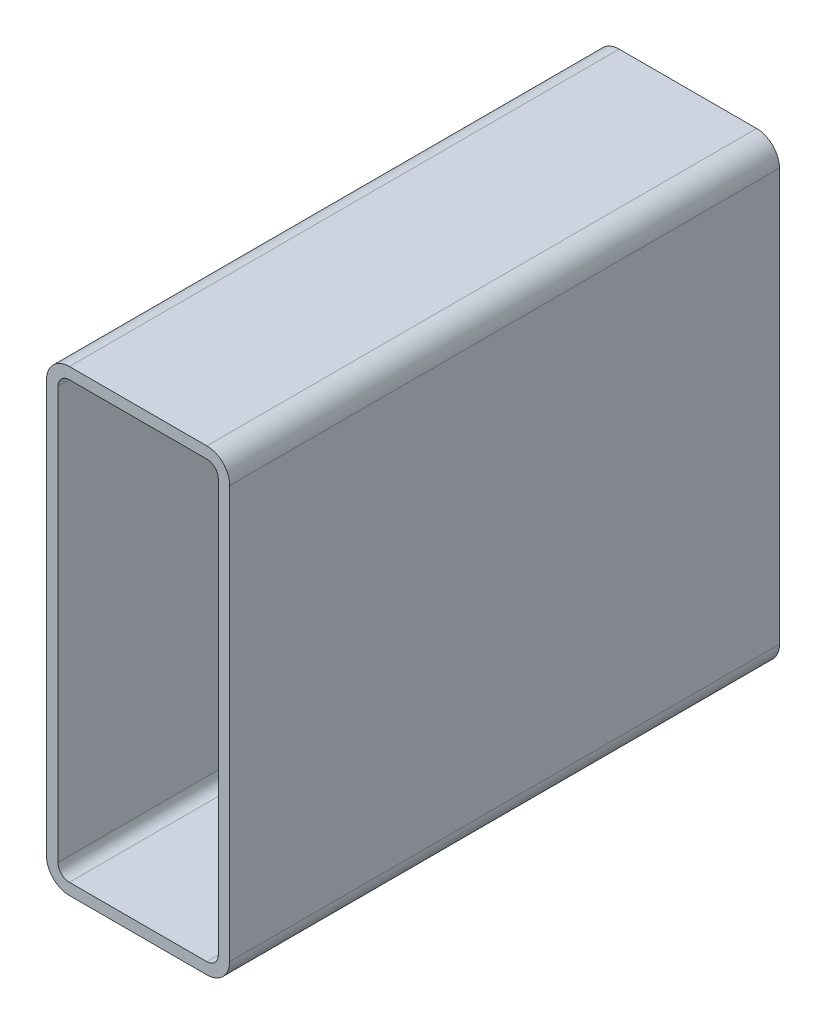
ISO-10303-21;
HEADER;
FILE_DESCRIPTION(('STEP AP214'),'2;1');
FILE_NAME('part.step','',(''),(''),'','','');
FILE_SCHEMA(('AUTOMOTIVE_DESIGN { 1 0 10303 214 1 1 1 1 }'));
ENDSEC;
DATA;
#1=APPLICATION_CONTEXT('core data for automotive mechanical design processes');
#2=APPLICATION_PROTOCOL_DEFINITION('international standard','automotive_design',2000,#1);
#3=PRODUCT_CONTEXT('',#1,'mechanical');
#4=PRODUCT('Part','Part','',(#3));
#5=PRODUCT_RELATED_PRODUCT_CATEGORY('part','',(#4));
#6=PRODUCT_DEFINITION_FORMATION('','',#4);
#7=PRODUCT_DEFINITION_CONTEXT('part definition',#1,'design');
#8=PRODUCT_DEFINITION('design','',#6,#7);
#9=PRODUCT_DEFINITION_SHAPE('','',#8);
#10=(LENGTH_UNIT() NAMED_UNIT(*) SI_UNIT(.MILLI.,.METRE.));
#11=(NAMED_UNIT(*) PLANE_ANGLE_UNIT() SI_UNIT($,.RADIAN.));
#12=(NAMED_UNIT(*) SI_UNIT($,.STERADIAN.) SOLID_ANGLE_UNIT());
#13=UNCERTAINTY_MEASURE_WITH_UNIT(LENGTH_MEASURE(1.E-05),#10,'distance_accuracy_value','');
#14=(GEOMETRIC_REPRESENTATION_CONTEXT(3) GLOBAL_UNCERTAINTY_ASSIGNED_CONTEXT((#13)) GLOBAL_UNIT_ASSIGNED_CONTEXT((#10,
#11,#12)) REPRESENTATION_CONTEXT('',''));
#15=CARTESIAN_POINT('',(0.,0.,0.));
#16=DIRECTION('',(0.,0.,1.));
#17=DIRECTION('',(1.,0.,0.));
#18=AXIS2_PLACEMENT_3D('',#15,#16,#17);
#19=CARTESIAN_POINT('',(14.3751778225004,243.220313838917,304.8));
#20=DIRECTION('',(0.,0.,1.));
#21=DIRECTION('',(1.,0.,0.));
#22=AXIS2_PLACEMENT_3D('',#19,#20,#21);
#23=PLANE('',#22);
#24=CARTESIAN_POINT('',(14.3751778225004,243.220313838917,304.8));
#25=DIRECTION('',(0.,0.,1.));
#26=DIRECTION('',(1.,0.,0.));
#27=AXIS2_PLACEMENT_3D('',#24,#25,#26);
#28=CIRCLE('',#27,12.7);
#29=CARTESIAN_POINT('',(14.3751778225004,255.920313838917,304.8));
#30=VERTEX_POINT('',#29);
#31=CARTESIAN_POINT('',(1.67517782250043,243.220313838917,304.8));
#32=VERTEX_POINT('',#31);
#33=EDGE_CURVE('E211',#30,#32,#28,.T.);
#34=ORIENTED_EDGE('',*,*,#33,.T.);
#35=DIRECTION('',(0.,-1.,0.));
#36=VECTOR('',#35,1.);
#37=CARTESIAN_POINT('',(1.67517782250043,14.6203138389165,304.8));
#38=LINE('',#37,#36);
#39=CARTESIAN_POINT('',(1.67517782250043,14.6203138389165,304.8));
#40=VERTEX_POINT('',#39);
#41=EDGE_CURVE('E214',#32,#40,#38,.T.);
#42=ORIENTED_EDGE('',*,*,#41,.T.);
#43=CARTESIAN_POINT('',(14.3751778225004,14.6203138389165,304.8));
#44=DIRECTION('',(0.,0.,1.));
#45=DIRECTION('',(1.,0.,0.));
#46=AXIS2_PLACEMENT_3D('',#43,#44,#45);
#47=CIRCLE('',#46,12.7);
#48=CARTESIAN_POINT('',(14.3751778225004,1.92031383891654,304.8));
#49=VERTEX_POINT('',#48);
#50=EDGE_CURVE('E217',#40,#49,#47,.T.);
#51=ORIENTED_EDGE('',*,*,#50,.T.);
#52=DIRECTION('',(1.,0.,0.));
#53=VECTOR('',#52,1.);
#54=CARTESIAN_POINT('',(90.5751778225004,1.92031383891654,304.8));
#55=LINE('',#54,#53);
#56=CARTESIAN_POINT('',(90.5751778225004,1.92031383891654,304.8));
#57=VERTEX_POINT('',#56);
#58=EDGE_CURVE('E219',#49,#57,#55,.T.);
#59=ORIENTED_EDGE('',*,*,#58,.T.);
#60=CARTESIAN_POINT('',(90.5751778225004,14.6203138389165,304.8));
#61=DIRECTION('',(0.,0.,1.));
#62=DIRECTION('',(1.,0.,0.));
#63=AXIS2_PLACEMENT_3D('',#60,#61,#62);
#64=CIRCLE('',#63,12.7);
#65=CARTESIAN_POINT('',(103.2751778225,14.6203138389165,304.8));
#66=VERTEX_POINT('',#65);
#67=EDGE_CURVE('E221',#57,#66,#64,.T.);
#68=ORIENTED_EDGE('',*,*,#67,.T.);
#69=DIRECTION('',(0.,1.,0.));
#70=VECTOR('',#69,1.);
#71=CARTESIAN_POINT('',(103.2751778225,243.220313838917,304.8));
#72=LINE('',#71,#70);
#73=CARTESIAN_POINT('',(103.2751778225,243.220313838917,304.8));
#74=VERTEX_POINT('',#73);
#75=EDGE_CURVE('E223',#66,#74,#72,.T.);
#76=ORIENTED_EDGE('',*,*,#75,.T.);
#77=CARTESIAN_POINT('',(90.5751778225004,243.220313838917,304.8));
#78=DIRECTION('',(0.,0.,1.));
#79=DIRECTION('',(1.,0.,0.));
#80=AXIS2_PLACEMENT_3D('',#77,#78,#79);
#81=CIRCLE('',#80,12.7);
#82=CARTESIAN_POINT('',(90.5751778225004,255.920313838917,304.8));
#83=VERTEX_POINT('',#82);
#84=EDGE_CURVE('E225',#74,#83,#81,.T.);
#85=ORIENTED_EDGE('',*,*,#84,.T.);
#86=DIRECTION('',(-1.,0.,0.));
#87=VECTOR('',#86,1.);
#88=CARTESIAN_POINT('',(14.3751778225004,255.920313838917,304.8));
#89=LINE('',#88,#87);
#90=EDGE_CURVE('E227',#83,#30,#89,.T.);
#91=ORIENTED_EDGE('',*,*,#90,.T.);
#92=EDGE_LOOP('',(#34,#42,#51,#59,#68,#76,#85,#91));
#93=FACE_BOUND('',#92,.T.);
#94=DIRECTION('',(0.,-1.,0.));
#95=VECTOR('',#94,1.);
#96=CARTESIAN_POINT('',(8.02517782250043,14.6203138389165,304.8));
#97=LINE('',#96,#95);
#98=CARTESIAN_POINT('',(8.02517782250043,243.220313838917,304.8));
#99=VERTEX_POINT('',#98);
#100=CARTESIAN_POINT('',(8.02517782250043,14.6203138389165,304.8));
#101=VERTEX_POINT('',#100);
#102=EDGE_CURVE('E154',#99,#101,#97,.T.);
#103=ORIENTED_EDGE('',*,*,#102,.F.);
#104=CARTESIAN_POINT('',(14.3751778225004,243.220313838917,304.8));
#105=DIRECTION('',(0.,0.,1.));
#106=DIRECTION('',(1.,0.,0.));
#107=AXIS2_PLACEMENT_3D('',#104,#105,#106);
#108=CIRCLE('',#107,6.35000000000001);
#109=CARTESIAN_POINT('',(14.3751778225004,249.570313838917,304.8));
#110=VERTEX_POINT('',#109);
#111=EDGE_CURVE('E146',#110,#99,#108,.T.);
#112=ORIENTED_EDGE('',*,*,#111,.F.);
#113=DIRECTION('',(-1.,0.,0.));
#114=VECTOR('',#113,1.);
#115=CARTESIAN_POINT('',(14.3751778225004,249.570313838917,304.8));
#116=LINE('',#115,#114);
#117=CARTESIAN_POINT('',(90.5751778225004,249.570313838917,304.8));
#118=VERTEX_POINT('',#117);
#119=EDGE_CURVE('E179',#118,#110,#116,.T.);
#120=ORIENTED_EDGE('',*,*,#119,.F.);
#121=CARTESIAN_POINT('',(90.5751778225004,243.220313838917,304.8));
#122=DIRECTION('',(0.,0.,1.));
#123=DIRECTION('',(1.,0.,0.));
#124=AXIS2_PLACEMENT_3D('',#121,#122,#123);
#125=CIRCLE('',#124,6.35000000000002);
#126=CARTESIAN_POINT('',(96.9251778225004,243.220313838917,304.8));
#127=VERTEX_POINT('',#126);
#128=EDGE_CURVE('E177',#127,#118,#125,.T.);
#129=ORIENTED_EDGE('',*,*,#128,.F.);
#130=DIRECTION('',(0.,1.,0.));
#131=VECTOR('',#130,1.);
#132=CARTESIAN_POINT('',(96.9251778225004,243.220313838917,304.8));
#133=LINE('',#132,#131);
#134=CARTESIAN_POINT('',(96.9251778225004,14.6203138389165,304.8));
#135=VERTEX_POINT('',#134);
#136=EDGE_CURVE('E175',#135,#127,#133,.T.);
#137=ORIENTED_EDGE('',*,*,#136,.F.);
#138=CARTESIAN_POINT('',(90.5751778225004,14.6203138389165,304.8));
#139=DIRECTION('',(0.,0.,1.));
#140=DIRECTION('',(1.,0.,0.));
#141=AXIS2_PLACEMENT_3D('',#138,#139,#140);
#142=CIRCLE('',#141,6.35000000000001);
#143=CARTESIAN_POINT('',(90.5751778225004,8.27031383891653,304.8));
#144=VERTEX_POINT('',#143);
#145=EDGE_CURVE('E173',#144,#135,#142,.T.);
#146=ORIENTED_EDGE('',*,*,#145,.F.);
#147=DIRECTION('',(1.,0.,0.));
#148=VECTOR('',#147,1.);
#149=CARTESIAN_POINT('',(90.5751778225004,8.27031383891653,304.8));
#150=LINE('',#149,#148);
#151=CARTESIAN_POINT('',(14.3751778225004,8.27031383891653,304.8));
#152=VERTEX_POINT('',#151);
#153=EDGE_CURVE('E169',#152,#144,#150,.T.);
#154=ORIENTED_EDGE('',*,*,#153,.F.);
#155=CARTESIAN_POINT('',(14.3751778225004,14.6203138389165,304.8));
#156=DIRECTION('',(0.,0.,1.));
#157=DIRECTION('',(1.,0.,0.));
#158=AXIS2_PLACEMENT_3D('',#155,#156,#157);
#159=CIRCLE('',#158,6.35);
#160=EDGE_CURVE('E167',#101,#152,#159,.T.);
#161=ORIENTED_EDGE('',*,*,#160,.F.);
#162=EDGE_LOOP('',(#103,#112,#120,#129,#137,#146,#154,#161));
#163=FACE_BOUND('',#162,.T.);
#164=ADVANCED_FACE('F33',(#93,#163),#23,.T.);
#165=CARTESIAN_POINT('',(14.3751778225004,243.220313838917,0.));
#166=DIRECTION('',(0.,0.,1.));
#167=DIRECTION('',(1.,0.,0.));
#168=AXIS2_PLACEMENT_3D('',#165,#166,#167);
#169=PLANE('',#168);
#170=CARTESIAN_POINT('',(14.3751778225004,243.220313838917,0.));
#171=DIRECTION('',(0.,0.,1.));
#172=DIRECTION('',(1.,0.,0.));
#173=AXIS2_PLACEMENT_3D('',#170,#171,#172);
#174=CIRCLE('',#173,12.7);
#175=CARTESIAN_POINT('',(14.3751778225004,255.920313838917,0.));
#176=VERTEX_POINT('',#175);
#177=CARTESIAN_POINT('',(1.67517782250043,243.220313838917,0.));
#178=VERTEX_POINT('',#177);
#179=EDGE_CURVE('E162',#176,#178,#174,.T.);
#180=ORIENTED_EDGE('',*,*,#179,.F.);
#181=DIRECTION('',(-1.,0.,0.));
#182=VECTOR('',#181,1.);
#183=CARTESIAN_POINT('',(14.3751778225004,255.920313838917,0.));
#184=LINE('',#183,#182);
#185=CARTESIAN_POINT('',(90.5751778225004,255.920313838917,0.));
#186=VERTEX_POINT('',#185);
#187=EDGE_CURVE('E215',#186,#176,#184,.T.);
#188=ORIENTED_EDGE('',*,*,#187,.F.);
#189=CARTESIAN_POINT('',(90.5751778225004,243.220313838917,0.));
#190=DIRECTION('',(0.,0.,1.));
#191=DIRECTION('',(1.,0.,0.));
#192=AXIS2_PLACEMENT_3D('',#189,#190,#191);
#193=CIRCLE('',#192,12.7);
#194=CARTESIAN_POINT('',(103.2751778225,243.220313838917,0.));
#195=VERTEX_POINT('',#194);
#196=EDGE_CURVE('E242',#195,#186,#193,.T.);
#197=ORIENTED_EDGE('',*,*,#196,.F.);
#198=DIRECTION('',(0.,1.,0.));
#199=VECTOR('',#198,1.);
#200=CARTESIAN_POINT('',(103.2751778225,243.220313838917,0.));
#201=LINE('',#200,#199);
#202=CARTESIAN_POINT('',(103.2751778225,14.6203138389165,0.));
#203=VERTEX_POINT('',#202);
#204=EDGE_CURVE('E240',#203,#195,#201,.T.);
#205=ORIENTED_EDGE('',*,*,#204,.F.);
#206=CARTESIAN_POINT('',(90.5751778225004,14.6203138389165,0.));
#207=DIRECTION('',(0.,0.,1.));
#208=DIRECTION('',(1.,0.,0.));
#209=AXIS2_PLACEMENT_3D('',#206,#207,#208);
#210=CIRCLE('',#209,12.7);
#211=CARTESIAN_POINT('',(90.5751778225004,1.92031383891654,0.));
#212=VERTEX_POINT('',#211);
#213=EDGE_CURVE('E238',#212,#203,#210,.T.);
#214=ORIENTED_EDGE('',*,*,#213,.F.);
#215=DIRECTION('',(1.,0.,0.));
#216=VECTOR('',#215,1.);
#217=CARTESIAN_POINT('',(90.5751778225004,1.92031383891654,0.));
#218=LINE('',#217,#216);
#219=CARTESIAN_POINT('',(14.3751778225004,1.92031383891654,0.));
#220=VERTEX_POINT('',#219);
#221=EDGE_CURVE('E236',#220,#212,#218,.T.);
#222=ORIENTED_EDGE('',*,*,#221,.F.);
#223=CARTESIAN_POINT('',(14.3751778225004,14.6203138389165,0.));
#224=DIRECTION('',(0.,0.,1.));
#225=DIRECTION('',(1.,0.,0.));
#226=AXIS2_PLACEMENT_3D('',#223,#224,#225);
#227=CIRCLE('',#226,12.7);
#228=CARTESIAN_POINT('',(1.67517782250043,14.6203138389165,0.));
#229=VERTEX_POINT('',#228);
#230=EDGE_CURVE('E234',#229,#220,#227,.T.);
#231=ORIENTED_EDGE('',*,*,#230,.F.);
#232=DIRECTION('',(0.,-1.,0.));
#233=VECTOR('',#232,1.);
#234=CARTESIAN_POINT('',(1.67517782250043,14.6203138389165,0.));
#235=LINE('',#234,#233);
#236=EDGE_CURVE('E232',#178,#229,#235,.T.);
#237=ORIENTED_EDGE('',*,*,#236,.F.);
#238=EDGE_LOOP('',(#180,#188,#197,#205,#214,#222,#231,#237));
#239=FACE_BOUND('',#238,.T.);
#240=CARTESIAN_POINT('',(14.3751778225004,243.220313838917,0.));
#241=DIRECTION('',(0.,0.,1.));
#242=DIRECTION('',(1.,0.,0.));
#243=AXIS2_PLACEMENT_3D('',#240,#241,#242);
#244=CIRCLE('',#243,6.35000000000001);
#245=CARTESIAN_POINT('',(14.3751778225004,249.570313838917,0.));
#246=VERTEX_POINT('',#245);
#247=CARTESIAN_POINT('',(8.02517782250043,243.220313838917,0.));
#248=VERTEX_POINT('',#247);
#249=EDGE_CURVE('E56',#246,#248,#244,.T.);
#250=ORIENTED_EDGE('',*,*,#249,.T.);
#251=DIRECTION('',(0.,-1.,0.));
#252=VECTOR('',#251,1.);
#253=CARTESIAN_POINT('',(8.02517782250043,14.6203138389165,0.));
#254=LINE('',#253,#252);
#255=CARTESIAN_POINT('',(8.02517782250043,14.6203138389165,0.));
#256=VERTEX_POINT('',#255);
#257=EDGE_CURVE('E161',#248,#256,#254,.T.);
#258=ORIENTED_EDGE('',*,*,#257,.T.);
#259=CARTESIAN_POINT('',(14.3751778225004,14.6203138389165,0.));
#260=DIRECTION('',(0.,0.,1.));
#261=DIRECTION('',(1.,0.,0.));
#262=AXIS2_PLACEMENT_3D('',#259,#260,#261);
#263=CIRCLE('',#262,6.35);
#264=CARTESIAN_POINT('',(14.3751778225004,8.27031383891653,0.));
#265=VERTEX_POINT('',#264);
#266=EDGE_CURVE('E183',#256,#265,#263,.T.);
#267=ORIENTED_EDGE('',*,*,#266,.T.);
#268=DIRECTION('',(1.,0.,0.));
#269=VECTOR('',#268,1.);
#270=CARTESIAN_POINT('',(90.5751778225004,8.27031383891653,0.));
#271=LINE('',#270,#269);
#272=CARTESIAN_POINT('',(90.5751778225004,8.27031383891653,0.));
#273=VERTEX_POINT('',#272);
#274=EDGE_CURVE('E186',#265,#273,#271,.T.);
#275=ORIENTED_EDGE('',*,*,#274,.T.);
#276=CARTESIAN_POINT('',(90.5751778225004,14.6203138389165,0.));
#277=DIRECTION('',(0.,0.,1.));
#278=DIRECTION('',(1.,0.,0.));
#279=AXIS2_PLACEMENT_3D('',#276,#277,#278);
#280=CIRCLE('',#279,6.35000000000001);
#281=CARTESIAN_POINT('',(96.9251778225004,14.6203138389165,0.));
#282=VERTEX_POINT('',#281);
#283=EDGE_CURVE('E189',#273,#282,#280,.T.);
#284=ORIENTED_EDGE('',*,*,#283,.T.);
#285=DIRECTION('',(0.,1.,0.));
#286=VECTOR('',#285,1.);
#287=CARTESIAN_POINT('',(96.9251778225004,243.220313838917,0.));
#288=LINE('',#287,#286);
#289=CARTESIAN_POINT('',(96.9251778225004,243.220313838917,0.));
#290=VERTEX_POINT('',#289);
#291=EDGE_CURVE('E192',#282,#290,#288,.T.);
#292=ORIENTED_EDGE('',*,*,#291,.T.);
#293=CARTESIAN_POINT('',(90.5751778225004,243.220313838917,0.));
#294=DIRECTION('',(0.,0.,1.));
#295=DIRECTION('',(1.,0.,0.));
#296=AXIS2_PLACEMENT_3D('',#293,#294,#295);
#297=CIRCLE('',#296,6.35000000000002);
#298=CARTESIAN_POINT('',(90.5751778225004,249.570313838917,0.));
#299=VERTEX_POINT('',#298);
#300=EDGE_CURVE('E195',#290,#299,#297,.T.);
#301=ORIENTED_EDGE('',*,*,#300,.T.);
#302=DIRECTION('',(-1.,0.,0.));
#303=VECTOR('',#302,1.);
#304=CARTESIAN_POINT('',(14.3751778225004,249.570313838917,0.));
#305=LINE('',#304,#303);
#306=EDGE_CURVE('E155',#299,#246,#305,.T.);
#307=ORIENTED_EDGE('',*,*,#306,.T.);
#308=EDGE_LOOP('',(#250,#258,#267,#275,#284,#292,#301,#307));
#309=FACE_BOUND('',#308,.T.);
#310=ADVANCED_FACE('F272',(#239,#309),#169,.F.);
#311=CARTESIAN_POINT('',(14.3751778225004,243.220313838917,304.8));
#312=DIRECTION('',(0.,0.,-1.));
#313=DIRECTION('',(-1.,0.,0.));
#314=AXIS2_PLACEMENT_3D('',#311,#312,#313);
#315=CYLINDRICAL_SURFACE('',#314,12.7);
#316=ORIENTED_EDGE('',*,*,#179,.T.);
#317=DIRECTION('',(0.,0.,-1.));
#318=VECTOR('',#317,1.);
#319=CARTESIAN_POINT('',(1.67517782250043,243.220313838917,304.8));
#320=LINE('',#319,#318);
#321=EDGE_CURVE('E11',#32,#178,#320,.T.);
#322=ORIENTED_EDGE('',*,*,#321,.F.);
#323=ORIENTED_EDGE('',*,*,#33,.F.);
#324=DIRECTION('',(0.,0.,-1.));
#325=VECTOR('',#324,1.);
#326=CARTESIAN_POINT('',(14.3751778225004,255.920313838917,304.8));
#327=LINE('',#326,#325);
#328=EDGE_CURVE('E229',#30,#176,#327,.T.);
#329=ORIENTED_EDGE('',*,*,#328,.T.);
#330=EDGE_LOOP('',(#316,#322,#323,#329));
#331=FACE_BOUND('',#330,.T.);
#332=ADVANCED_FACE('F35',(#331),#315,.T.);
#333=CARTESIAN_POINT('',(1.67517782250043,14.6203138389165,304.8));
#334=DIRECTION('',(1.,0.,0.));
#335=DIRECTION('',(0.,0.,-1.));
#336=AXIS2_PLACEMENT_3D('',#333,#334,#335);
#337=PLANE('',#336);
#338=ORIENTED_EDGE('',*,*,#236,.T.);
#339=DIRECTION('',(0.,0.,-1.));
#340=VECTOR('',#339,1.);
#341=CARTESIAN_POINT('',(1.67517782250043,14.6203138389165,304.8));
#342=LINE('',#341,#340);
#343=EDGE_CURVE('E41',#40,#229,#342,.T.);
#344=ORIENTED_EDGE('',*,*,#343,.F.);
#345=ORIENTED_EDGE('',*,*,#41,.F.);
#346=ORIENTED_EDGE('',*,*,#321,.T.);
#347=EDGE_LOOP('',(#338,#344,#345,#346));
#348=FACE_BOUND('',#347,.T.);
#349=ADVANCED_FACE('F289',(#348),#337,.F.);
#350=CARTESIAN_POINT('',(14.3751778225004,14.6203138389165,304.8));
#351=DIRECTION('',(0.,0.,-1.));
#352=DIRECTION('',(-1.,0.,0.));
#353=AXIS2_PLACEMENT_3D('',#350,#351,#352);
#354=CYLINDRICAL_SURFACE('',#353,12.7);
#355=ORIENTED_EDGE('',*,*,#230,.T.);
#356=DIRECTION('',(0.,0.,-1.));
#357=VECTOR('',#356,1.);
#358=CARTESIAN_POINT('',(14.3751778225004,1.92031383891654,304.8));
#359=LINE('',#358,#357);
#360=EDGE_CURVE('E259',#49,#220,#359,.T.);
#361=ORIENTED_EDGE('',*,*,#360,.F.);
#362=ORIENTED_EDGE('',*,*,#50,.F.);
#363=ORIENTED_EDGE('',*,*,#343,.T.);
#364=EDGE_LOOP('',(#355,#361,#362,#363));
#365=FACE_BOUND('',#364,.T.);
#366=ADVANCED_FACE('F266',(#365),#354,.T.);
#367=CARTESIAN_POINT('',(90.5751778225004,1.92031383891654,304.8));
#368=DIRECTION('',(0.,1.,0.));
#369=DIRECTION('',(0.,0.,1.));
#370=AXIS2_PLACEMENT_3D('',#367,#368,#369);
#371=PLANE('',#370);
#372=ORIENTED_EDGE('',*,*,#221,.T.);
#373=DIRECTION('',(0.,0.,-1.));
#374=VECTOR('',#373,1.);
#375=CARTESIAN_POINT('',(90.5751778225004,1.92031383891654,304.8));
#376=LINE('',#375,#374);
#377=EDGE_CURVE('E256',#57,#212,#376,.T.);
#378=ORIENTED_EDGE('',*,*,#377,.F.);
#379=ORIENTED_EDGE('',*,*,#58,.F.);
#380=ORIENTED_EDGE('',*,*,#360,.T.);
#381=EDGE_LOOP('',(#372,#378,#379,#380));
#382=FACE_BOUND('',#381,.T.);
#383=ADVANCED_FACE('F278',(#382),#371,.F.);
#384=CARTESIAN_POINT('',(90.5751778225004,14.6203138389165,304.8));
#385=DIRECTION('',(0.,0.,-1.));
#386=DIRECTION('',(-1.,0.,0.));
#387=AXIS2_PLACEMENT_3D('',#384,#385,#386);
#388=CYLINDRICAL_SURFACE('',#387,12.7);
#389=ORIENTED_EDGE('',*,*,#213,.T.);
#390=DIRECTION('',(0.,0.,-1.));
#391=VECTOR('',#390,1.);
#392=CARTESIAN_POINT('',(103.2751778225,14.6203138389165,304.8));
#393=LINE('',#392,#391);
#394=EDGE_CURVE('E253',#66,#203,#393,.T.);
#395=ORIENTED_EDGE('',*,*,#394,.F.);
#396=ORIENTED_EDGE('',*,*,#67,.F.);
#397=ORIENTED_EDGE('',*,*,#377,.T.);
#398=EDGE_LOOP('',(#389,#395,#396,#397));
#399=FACE_BOUND('',#398,.T.);
#400=ADVANCED_FACE('F282',(#399),#388,.T.);
#401=CARTESIAN_POINT('',(103.2751778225,243.220313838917,304.8));
#402=DIRECTION('',(-1.,0.,0.));
#403=DIRECTION('',(0.,0.,1.));
#404=AXIS2_PLACEMENT_3D('',#401,#402,#403);
#405=PLANE('',#404);
#406=ORIENTED_EDGE('',*,*,#204,.T.);
#407=DIRECTION('',(0.,0.,-1.));
#408=VECTOR('',#407,1.);
#409=CARTESIAN_POINT('',(103.2751778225,243.220313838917,304.8));
#410=LINE('',#409,#408);
#411=EDGE_CURVE('E250',#74,#195,#410,.T.);
#412=ORIENTED_EDGE('',*,*,#411,.F.);
#413=ORIENTED_EDGE('',*,*,#75,.F.);
#414=ORIENTED_EDGE('',*,*,#394,.T.);
#415=EDGE_LOOP('',(#406,#412,#413,#414));
#416=FACE_BOUND('',#415,.T.);
#417=ADVANCED_FACE('F302',(#416),#405,.F.);
#418=CARTESIAN_POINT('',(90.5751778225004,243.220313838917,304.8));
#419=DIRECTION('',(0.,0.,-1.));
#420=DIRECTION('',(-1.,0.,0.));
#421=AXIS2_PLACEMENT_3D('',#418,#419,#420);
#422=CYLINDRICAL_SURFACE('',#421,12.7);
#423=ORIENTED_EDGE('',*,*,#196,.T.);
#424=DIRECTION('',(0.,0.,-1.));
#425=VECTOR('',#424,1.);
#426=CARTESIAN_POINT('',(90.5751778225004,255.920313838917,304.8));
#427=LINE('',#426,#425);
#428=EDGE_CURVE('E247',#83,#186,#427,.T.);
#429=ORIENTED_EDGE('',*,*,#428,.F.);
#430=ORIENTED_EDGE('',*,*,#84,.F.);
#431=ORIENTED_EDGE('',*,*,#411,.T.);
#432=EDGE_LOOP('',(#423,#429,#430,#431));
#433=FACE_BOUND('',#432,.T.);
#434=ADVANCED_FACE('F300',(#433),#422,.T.);
#435=CARTESIAN_POINT('',(14.3751778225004,255.920313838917,304.8));
#436=DIRECTION('',(0.,-1.,0.));
#437=DIRECTION('',(0.,0.,-1.));
#438=AXIS2_PLACEMENT_3D('',#435,#436,#437);
#439=PLANE('',#438);
#440=ORIENTED_EDGE('',*,*,#187,.T.);
#441=ORIENTED_EDGE('',*,*,#328,.F.);
#442=ORIENTED_EDGE('',*,*,#90,.F.);
#443=ORIENTED_EDGE('',*,*,#428,.T.);
#444=EDGE_LOOP('',(#440,#441,#442,#443));
#445=FACE_BOUND('',#444,.T.);
#446=ADVANCED_FACE('F295',(#445),#439,.F.);
#447=CARTESIAN_POINT('',(14.3751778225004,243.220313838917,304.8));
#448=DIRECTION('',(0.,0.,-1.));
#449=DIRECTION('',(-1.,0.,0.));
#450=AXIS2_PLACEMENT_3D('',#447,#448,#449);
#451=CYLINDRICAL_SURFACE('',#450,6.35000000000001);
#452=ORIENTED_EDGE('',*,*,#249,.F.);
#453=DIRECTION('',(0.,0.,-1.));
#454=VECTOR('',#453,1.);
#455=CARTESIAN_POINT('',(14.3751778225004,249.570313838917,304.8));
#456=LINE('',#455,#454);
#457=EDGE_CURVE('E150',#110,#246,#456,.T.);
#458=ORIENTED_EDGE('',*,*,#457,.F.);
#459=ORIENTED_EDGE('',*,*,#111,.T.);
#460=DIRECTION('',(0.,0.,-1.));
#461=VECTOR('',#460,1.);
#462=CARTESIAN_POINT('',(8.02517782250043,243.220313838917,304.8));
#463=LINE('',#462,#461);
#464=EDGE_CURVE('E149',#99,#248,#463,.T.);
#465=ORIENTED_EDGE('',*,*,#464,.T.);
#466=EDGE_LOOP('',(#452,#458,#459,#465));
#467=FACE_BOUND('',#466,.T.);
#468=ADVANCED_FACE('F148',(#467),#451,.F.);
#469=CARTESIAN_POINT('',(8.02517782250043,14.6203138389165,304.8));
#470=DIRECTION('',(1.,0.,0.));
#471=DIRECTION('',(0.,0.,-1.));
#472=AXIS2_PLACEMENT_3D('',#469,#470,#471);
#473=PLANE('',#472);
#474=ORIENTED_EDGE('',*,*,#257,.F.);
#475=ORIENTED_EDGE('',*,*,#464,.F.);
#476=ORIENTED_EDGE('',*,*,#102,.T.);
#477=DIRECTION('',(0.,0.,-1.));
#478=VECTOR('',#477,1.);
#479=CARTESIAN_POINT('',(8.02517782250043,14.6203138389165,304.8));
#480=LINE('',#479,#478);
#481=EDGE_CURVE('E163',#101,#256,#480,.T.);
#482=ORIENTED_EDGE('',*,*,#481,.T.);
#483=EDGE_LOOP('',(#474,#475,#476,#482));
#484=FACE_BOUND('',#483,.T.);
#485=ADVANCED_FACE('F158',(#484),#473,.T.);
#486=CARTESIAN_POINT('',(14.3751778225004,14.6203138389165,304.8));
#487=DIRECTION('',(0.,0.,-1.));
#488=DIRECTION('',(-1.,0.,0.));
#489=AXIS2_PLACEMENT_3D('',#486,#487,#488);
#490=CYLINDRICAL_SURFACE('',#489,6.35);
#491=ORIENTED_EDGE('',*,*,#266,.F.);
#492=ORIENTED_EDGE('',*,*,#481,.F.);
#493=ORIENTED_EDGE('',*,*,#160,.T.);
#494=DIRECTION('',(0.,0.,-1.));
#495=VECTOR('',#494,1.);
#496=CARTESIAN_POINT('',(14.3751778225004,8.27031383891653,304.8));
#497=LINE('',#496,#495);
#498=EDGE_CURVE('E208',#152,#265,#497,.T.);
#499=ORIENTED_EDGE('',*,*,#498,.T.);
#500=EDGE_LOOP('',(#491,#492,#493,#499));
#501=FACE_BOUND('',#500,.T.);
#502=ADVANCED_FACE('F327',(#501),#490,.F.);
#503=CARTESIAN_POINT('',(90.5751778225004,8.27031383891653,304.8));
#504=DIRECTION('',(0.,1.,0.));
#505=DIRECTION('',(0.,0.,1.));
#506=AXIS2_PLACEMENT_3D('',#503,#504,#505);
#507=PLANE('',#506);
#508=ORIENTED_EDGE('',*,*,#274,.F.);
#509=ORIENTED_EDGE('',*,*,#498,.F.);
#510=ORIENTED_EDGE('',*,*,#153,.T.);
#511=DIRECTION('',(0.,0.,-1.));
#512=VECTOR('',#511,1.);
#513=CARTESIAN_POINT('',(90.5751778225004,8.27031383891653,304.8));
#514=LINE('',#513,#512);
#515=EDGE_CURVE('E206',#144,#273,#514,.T.);
#516=ORIENTED_EDGE('',*,*,#515,.T.);
#517=EDGE_LOOP('',(#508,#509,#510,#516));
#518=FACE_BOUND('',#517,.T.);
#519=ADVANCED_FACE('F331',(#518),#507,.T.);
#520=CARTESIAN_POINT('',(90.5751778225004,14.6203138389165,304.8));
#521=DIRECTION('',(0.,0.,-1.));
#522=DIRECTION('',(-1.,0.,0.));
#523=AXIS2_PLACEMENT_3D('',#520,#521,#522);
#524=CYLINDRICAL_SURFACE('',#523,6.35000000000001);
#525=ORIENTED_EDGE('',*,*,#283,.F.);
#526=ORIENTED_EDGE('',*,*,#515,.F.);
#527=ORIENTED_EDGE('',*,*,#145,.T.);
#528=DIRECTION('',(0.,0.,-1.));
#529=VECTOR('',#528,1.);
#530=CARTESIAN_POINT('',(96.9251778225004,14.6203138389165,304.8));
#531=LINE('',#530,#529);
#532=EDGE_CURVE('E204',#135,#282,#531,.T.);
#533=ORIENTED_EDGE('',*,*,#532,.T.);
#534=EDGE_LOOP('',(#525,#526,#527,#533));
#535=FACE_BOUND('',#534,.T.);
#536=ADVANCED_FACE('F337',(#535),#524,.F.);
#537=CARTESIAN_POINT('',(96.9251778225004,243.220313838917,304.8));
#538=DIRECTION('',(-1.,0.,0.));
#539=DIRECTION('',(0.,0.,1.));
#540=AXIS2_PLACEMENT_3D('',#537,#538,#539);
#541=PLANE('',#540);
#542=ORIENTED_EDGE('',*,*,#291,.F.);
#543=ORIENTED_EDGE('',*,*,#532,.F.);
#544=ORIENTED_EDGE('',*,*,#136,.T.);
#545=DIRECTION('',(0.,0.,-1.));
#546=VECTOR('',#545,1.);
#547=CARTESIAN_POINT('',(96.9251778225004,243.220313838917,304.8));
#548=LINE('',#547,#546);
#549=EDGE_CURVE('E202',#127,#290,#548,.T.);
#550=ORIENTED_EDGE('',*,*,#549,.T.);
#551=EDGE_LOOP('',(#542,#543,#544,#550));
#552=FACE_BOUND('',#551,.T.);
#553=ADVANCED_FACE('F341',(#552),#541,.T.);
#554=CARTESIAN_POINT('',(90.5751778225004,243.220313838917,304.8));
#555=DIRECTION('',(0.,0.,-1.));
#556=DIRECTION('',(-1.,0.,0.));
#557=AXIS2_PLACEMENT_3D('',#554,#555,#556);
#558=CYLINDRICAL_SURFACE('',#557,6.35000000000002);
#559=ORIENTED_EDGE('',*,*,#300,.F.);
#560=ORIENTED_EDGE('',*,*,#549,.F.);
#561=ORIENTED_EDGE('',*,*,#128,.T.);
#562=DIRECTION('',(0.,0.,-1.));
#563=VECTOR('',#562,1.);
#564=CARTESIAN_POINT('',(90.5751778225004,249.570313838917,304.8));
#565=LINE('',#564,#563);
#566=EDGE_CURVE('E48',#118,#299,#565,.T.);
#567=ORIENTED_EDGE('',*,*,#566,.T.);
#568=EDGE_LOOP('',(#559,#560,#561,#567));
#569=FACE_BOUND('',#568,.T.);
#570=ADVANCED_FACE('F345',(#569),#558,.F.);
#571=CARTESIAN_POINT('',(14.3751778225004,249.570313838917,304.8));
#572=DIRECTION('',(0.,-1.,0.));
#573=DIRECTION('',(0.,0.,-1.));
#574=AXIS2_PLACEMENT_3D('',#571,#572,#573);
#575=PLANE('',#574);
#576=ORIENTED_EDGE('',*,*,#306,.F.);
#577=ORIENTED_EDGE('',*,*,#566,.F.);
#578=ORIENTED_EDGE('',*,*,#119,.T.);
#579=ORIENTED_EDGE('',*,*,#457,.T.);
#580=EDGE_LOOP('',(#576,#577,#578,#579));
#581=FACE_BOUND('',#580,.T.);
#582=ADVANCED_FACE('F349',(#581),#575,.T.);
#583=CLOSED_SHELL('',(#164,#310,#332,#349,#366,#383,#400,#417,#434,#446,#468,#485,#502,#519,
#536,#553,#570,#582));
#584=MANIFOLD_SOLID_BREP('B2',#583);
#585=ADVANCED_BREP_SHAPE_REPRESENTATION('',(#18,#584),#14);
#586=SHAPE_DEFINITION_REPRESENTATION(#9,#585);
ENDSEC;
END-ISO-10303-21;
